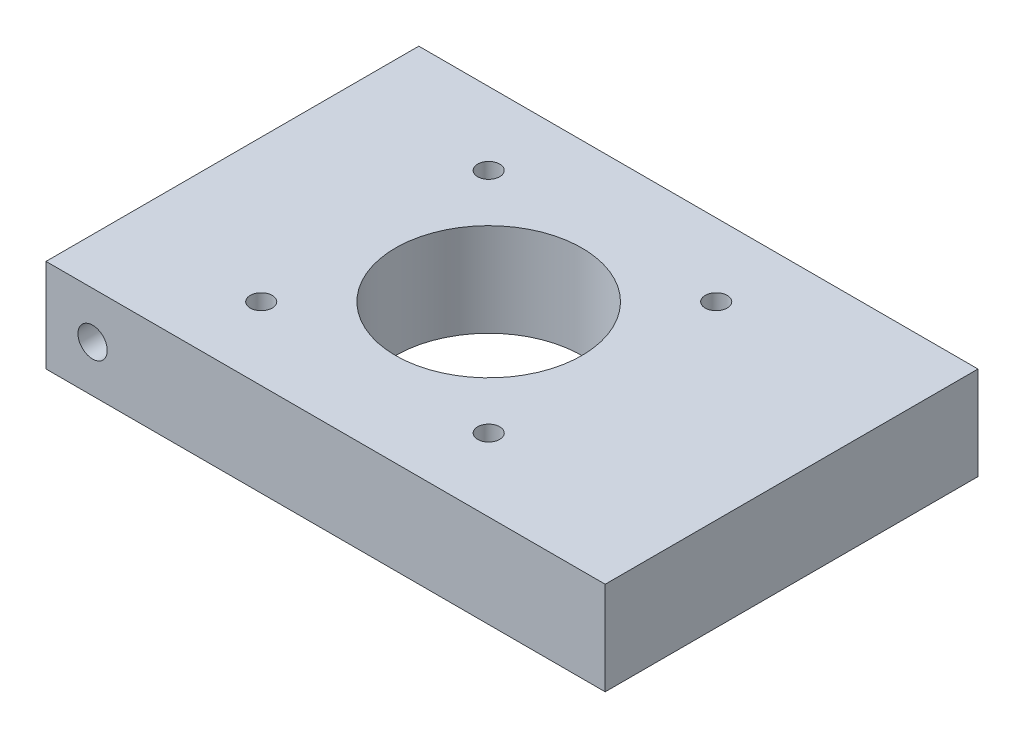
ISO-10303-21;
HEADER;
FILE_DESCRIPTION(('STEP AP214'),'2;1');
FILE_NAME('part.step','',(''),(''),'','','');
FILE_SCHEMA(('AUTOMOTIVE_DESIGN { 1 0 10303 214 1 1 1 1 }'));
ENDSEC;
DATA;
#1=APPLICATION_CONTEXT('core data for automotive mechanical design processes');
#2=APPLICATION_PROTOCOL_DEFINITION('international standard','automotive_design',2000,#1);
#3=PRODUCT_CONTEXT('',#1,'mechanical');
#4=PRODUCT('Part','Part','',(#3));
#5=PRODUCT_RELATED_PRODUCT_CATEGORY('part','',(#4));
#6=PRODUCT_DEFINITION_FORMATION('','',#4);
#7=PRODUCT_DEFINITION_CONTEXT('part definition',#1,'design');
#8=PRODUCT_DEFINITION('design','',#6,#7);
#9=PRODUCT_DEFINITION_SHAPE('','',#8);
#10=(LENGTH_UNIT() NAMED_UNIT(*) SI_UNIT(.MILLI.,.METRE.));
#11=(NAMED_UNIT(*) PLANE_ANGLE_UNIT() SI_UNIT($,.RADIAN.));
#12=(NAMED_UNIT(*) SI_UNIT($,.STERADIAN.) SOLID_ANGLE_UNIT());
#13=UNCERTAINTY_MEASURE_WITH_UNIT(LENGTH_MEASURE(1.E-05),#10,'distance_accuracy_value','');
#14=(GEOMETRIC_REPRESENTATION_CONTEXT(3) GLOBAL_UNCERTAINTY_ASSIGNED_CONTEXT((#13)) GLOBAL_UNIT_ASSIGNED_CONTEXT((#10,
#11,#12)) REPRESENTATION_CONTEXT('',''));
#15=CARTESIAN_POINT('',(0.,0.,0.));
#16=DIRECTION('',(0.,0.,1.));
#17=DIRECTION('',(1.,0.,0.));
#18=AXIS2_PLACEMENT_3D('',#15,#16,#17);
#19=CARTESIAN_POINT('',(-1.53286803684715,6.35,14.8318881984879));
#20=DIRECTION('',(0.,0.,-1.));
#21=DIRECTION('',(-1.,0.,0.));
#22=AXIS2_PLACEMENT_3D('',#19,#20,#21);
#23=CYLINDRICAL_SURFACE('',#22,2.);
#24=CARTESIAN_POINT('',(-1.53286803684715,6.35,-35.9681118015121));
#25=DIRECTION('',(0.,0.,-1.));
#26=DIRECTION('',(-1.,0.,0.));
#27=AXIS2_PLACEMENT_3D('',#24,#25,#26);
#28=CIRCLE('',#27,2.);
#29=CARTESIAN_POINT('',(-3.53286803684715,6.35,-35.9681118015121));
#30=VERTEX_POINT('',#29);
#31=EDGE_CURVE('E204',#30,#30,#28,.T.);
#32=ORIENTED_EDGE('',*,*,#31,.T.);
#33=EDGE_LOOP('',(#32));
#34=FACE_BOUND('',#33,.T.);
#35=CARTESIAN_POINT('',(-1.53286803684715,6.35,-10.5681118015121));
#36=DIRECTION('',(0.,0.,1.));
#37=DIRECTION('',(1.,0.,0.));
#38=AXIS2_PLACEMENT_3D('',#35,#36,#37);
#39=CIRCLE('',#38,2.);
#40=CARTESIAN_POINT('',(0.467131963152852,6.35,-10.5681118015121));
#41=VERTEX_POINT('',#40);
#42=EDGE_CURVE('E11',#41,#41,#39,.F.);
#43=ORIENTED_EDGE('',*,*,#42,.F.);
#44=EDGE_LOOP('',(#43));
#45=FACE_BOUND('',#44,.T.);
#46=ADVANCED_FACE('F33',(#34,#45),#23,.F.);
#47=CARTESIAN_POINT('',(-71.3828680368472,12.7,-35.9681118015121));
#48=DIRECTION('',(1.,0.,0.));
#49=DIRECTION('',(0.,0.,-1.));
#50=AXIS2_PLACEMENT_3D('',#47,#48,#49);
#51=PLANE('',#50);
#52=DIRECTION('',(0.,0.,1.));
#53=VECTOR('',#52,1.);
#54=CARTESIAN_POINT('',(-71.3828680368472,0.,-35.9681118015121));
#55=LINE('',#54,#53);
#56=CARTESIAN_POINT('',(-71.3828680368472,0.,-35.9681118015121));
#57=VERTEX_POINT('',#56);
#58=CARTESIAN_POINT('',(-71.3828680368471,0.,14.8318881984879));
#59=VERTEX_POINT('',#58);
#60=EDGE_CURVE('E100',#57,#59,#55,.T.);
#61=ORIENTED_EDGE('',*,*,#60,.T.);
#62=DIRECTION('',(0.,-1.,0.));
#63=VECTOR('',#62,1.);
#64=CARTESIAN_POINT('',(-71.3828680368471,12.7,14.8318881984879));
#65=LINE('',#64,#63);
#66=CARTESIAN_POINT('',(-71.3828680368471,12.7,14.8318881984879));
#67=VERTEX_POINT('',#66);
#68=EDGE_CURVE('E42',#67,#59,#65,.T.);
#69=ORIENTED_EDGE('',*,*,#68,.F.);
#70=DIRECTION('',(0.,0.,1.));
#71=VECTOR('',#70,1.);
#72=CARTESIAN_POINT('',(-71.3828680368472,12.7,-35.9681118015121));
#73=LINE('',#72,#71);
#74=CARTESIAN_POINT('',(-71.3828680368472,12.7,-35.9681118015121));
#75=VERTEX_POINT('',#74);
#76=EDGE_CURVE('E86',#75,#67,#73,.T.);
#77=ORIENTED_EDGE('',*,*,#76,.F.);
#78=DIRECTION('',(0.,-1.,0.));
#79=VECTOR('',#78,1.);
#80=CARTESIAN_POINT('',(-71.3828680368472,12.7,-35.9681118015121));
#81=LINE('',#80,#79);
#82=EDGE_CURVE('E96',#75,#57,#81,.T.);
#83=ORIENTED_EDGE('',*,*,#82,.T.);
#84=EDGE_LOOP('',(#61,#69,#77,#83));
#85=FACE_BOUND('',#84,.T.);
#86=ADVANCED_FACE('F35',(#85),#51,.F.);
#87=CARTESIAN_POINT('',(-71.3828680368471,12.7,14.8318881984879));
#88=DIRECTION('',(0.,0.,-1.));
#89=DIRECTION('',(-1.,0.,0.));
#90=AXIS2_PLACEMENT_3D('',#87,#88,#89);
#91=PLANE('',#90);
#92=CARTESIAN_POINT('',(-65.0328680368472,6.35,14.8318881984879));
#93=DIRECTION('',(0.,0.,-1.));
#94=DIRECTION('',(-1.,0.,0.));
#95=AXIS2_PLACEMENT_3D('',#92,#93,#94);
#96=CIRCLE('',#95,2.);
#97=CARTESIAN_POINT('',(-67.0328680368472,6.35,14.8318881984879));
#98=VERTEX_POINT('',#97);
#99=EDGE_CURVE('E199',#98,#98,#96,.T.);
#100=ORIENTED_EDGE('',*,*,#99,.T.);
#101=EDGE_LOOP('',(#100));
#102=FACE_BOUND('',#101,.T.);
#103=DIRECTION('',(1.,0.,0.));
#104=VECTOR('',#103,1.);
#105=CARTESIAN_POINT('',(-71.3828680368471,0.,14.8318881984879));
#106=LINE('',#105,#104);
#107=CARTESIAN_POINT('',(4.81713196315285,0.,14.8318881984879));
#108=VERTEX_POINT('',#107);
#109=EDGE_CURVE('E91',#59,#108,#106,.T.);
#110=ORIENTED_EDGE('',*,*,#109,.T.);
#111=DIRECTION('',(0.,-1.,0.));
#112=VECTOR('',#111,1.);
#113=CARTESIAN_POINT('',(4.81713196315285,12.7,14.8318881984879));
#114=LINE('',#113,#112);
#115=CARTESIAN_POINT('',(4.81713196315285,12.7,14.8318881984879));
#116=VERTEX_POINT('',#115);
#117=EDGE_CURVE('E89',#116,#108,#114,.T.);
#118=ORIENTED_EDGE('',*,*,#117,.F.);
#119=DIRECTION('',(1.,0.,0.));
#120=VECTOR('',#119,1.);
#121=CARTESIAN_POINT('',(-71.3828680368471,12.7,14.8318881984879));
#122=LINE('',#121,#120);
#123=EDGE_CURVE('E81',#67,#116,#122,.T.);
#124=ORIENTED_EDGE('',*,*,#123,.F.);
#125=ORIENTED_EDGE('',*,*,#68,.T.);
#126=EDGE_LOOP('',(#110,#118,#124,#125));
#127=FACE_BOUND('',#126,.T.);
#128=ADVANCED_FACE('F90',(#102,#127),#91,.F.);
#129=CARTESIAN_POINT('',(4.81713196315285,12.7,-35.9681118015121));
#130=DIRECTION('',(-1.,0.,0.));
#131=DIRECTION('',(0.,0.,1.));
#132=AXIS2_PLACEMENT_3D('',#129,#130,#131);
#133=PLANE('',#132);
#134=DIRECTION('',(0.,0.,-1.));
#135=VECTOR('',#134,1.);
#136=CARTESIAN_POINT('',(4.81713196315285,0.,-35.9681118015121));
#137=LINE('',#136,#135);
#138=CARTESIAN_POINT('',(4.81713196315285,0.,-35.9681118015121));
#139=VERTEX_POINT('',#138);
#140=EDGE_CURVE('E67',#108,#139,#137,.T.);
#141=ORIENTED_EDGE('',*,*,#140,.T.);
#142=DIRECTION('',(0.,-1.,0.));
#143=VECTOR('',#142,1.);
#144=CARTESIAN_POINT('',(4.81713196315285,12.7,-35.9681118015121));
#145=LINE('',#144,#143);
#146=CARTESIAN_POINT('',(4.81713196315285,12.7,-35.9681118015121));
#147=VERTEX_POINT('',#146);
#148=EDGE_CURVE('E92',#147,#139,#145,.T.);
#149=ORIENTED_EDGE('',*,*,#148,.F.);
#150=DIRECTION('',(0.,0.,-1.));
#151=VECTOR('',#150,1.);
#152=CARTESIAN_POINT('',(4.81713196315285,12.7,-35.9681118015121));
#153=LINE('',#152,#151);
#154=EDGE_CURVE('E84',#116,#147,#153,.T.);
#155=ORIENTED_EDGE('',*,*,#154,.F.);
#156=ORIENTED_EDGE('',*,*,#117,.T.);
#157=EDGE_LOOP('',(#141,#149,#155,#156));
#158=FACE_BOUND('',#157,.T.);
#159=ADVANCED_FACE('F94',(#158),#133,.F.);
#160=CARTESIAN_POINT('',(-71.3828680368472,12.7,-35.9681118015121));
#161=DIRECTION('',(0.,0.,1.));
#162=DIRECTION('',(1.,0.,0.));
#163=AXIS2_PLACEMENT_3D('',#160,#161,#162);
#164=PLANE('',#163);
#165=ORIENTED_EDGE('',*,*,#31,.F.);
#166=EDGE_LOOP('',(#165));
#167=FACE_BOUND('',#166,.T.);
#168=CARTESIAN_POINT('',(-65.0328680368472,6.35,-35.9681118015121));
#169=DIRECTION('',(0.,0.,-1.));
#170=DIRECTION('',(-1.,0.,0.));
#171=AXIS2_PLACEMENT_3D('',#168,#169,#170);
#172=CIRCLE('',#171,2.);
#173=CARTESIAN_POINT('',(-67.0328680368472,6.35,-35.9681118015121));
#174=VERTEX_POINT('',#173);
#175=EDGE_CURVE('E201',#174,#174,#172,.T.);
#176=ORIENTED_EDGE('',*,*,#175,.F.);
#177=EDGE_LOOP('',(#176));
#178=FACE_BOUND('',#177,.T.);
#179=DIRECTION('',(-1.,0.,0.));
#180=VECTOR('',#179,1.);
#181=CARTESIAN_POINT('',(-71.3828680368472,0.,-35.9681118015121));
#182=LINE('',#181,#180);
#183=EDGE_CURVE('E73',#139,#57,#182,.T.);
#184=ORIENTED_EDGE('',*,*,#183,.T.);
#185=ORIENTED_EDGE('',*,*,#82,.F.);
#186=DIRECTION('',(-1.,0.,0.));
#187=VECTOR('',#186,1.);
#188=CARTESIAN_POINT('',(-71.3828680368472,12.7,-35.9681118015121));
#189=LINE('',#188,#187);
#190=EDGE_CURVE('E50',#147,#75,#189,.T.);
#191=ORIENTED_EDGE('',*,*,#190,.F.);
#192=ORIENTED_EDGE('',*,*,#148,.T.);
#193=EDGE_LOOP('',(#184,#185,#191,#192));
#194=FACE_BOUND('',#193,.T.);
#195=ADVANCED_FACE('F123',(#167,#178,#194),#164,.F.);
#196=CARTESIAN_POINT('',(-71.3828680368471,12.7,14.8318881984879));
#197=DIRECTION('',(0.,1.,0.));
#198=DIRECTION('',(0.,0.,1.));
#199=AXIS2_PLACEMENT_3D('',#196,#197,#198);
#200=PLANE('',#199);
#201=CARTESIAN_POINT('',(-51.9578680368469,12.7,4.93188819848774));
#202=DIRECTION('',(0.,1.,0.));
#203=DIRECTION('',(0.,0.,1.));
#204=AXIS2_PLACEMENT_3D('',#201,#202,#203);
#205=CIRCLE('',#204,1.50000000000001);
#206=CARTESIAN_POINT('',(-51.9578680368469,12.7,6.43188819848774));
#207=VERTEX_POINT('',#206);
#208=EDGE_CURVE('E196',#207,#207,#205,.T.);
#209=ORIENTED_EDGE('',*,*,#208,.F.);
#210=EDGE_LOOP('',(#209));
#211=FACE_BOUND('',#210,.T.);
#212=CARTESIAN_POINT('',(-20.9578680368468,12.7,4.93188819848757));
#213=DIRECTION('',(0.,1.,0.));
#214=DIRECTION('',(0.,0.,1.));
#215=AXIS2_PLACEMENT_3D('',#212,#213,#214);
#216=CIRCLE('',#215,1.50000000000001);
#217=CARTESIAN_POINT('',(-20.9578680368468,12.7,6.43188819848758));
#218=VERTEX_POINT('',#217);
#219=EDGE_CURVE('E190',#218,#218,#216,.T.);
#220=ORIENTED_EDGE('',*,*,#219,.F.);
#221=EDGE_LOOP('',(#220));
#222=FACE_BOUND('',#221,.T.);
#223=CARTESIAN_POINT('',(-20.9578680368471,12.7,-26.0681118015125));
#224=DIRECTION('',(0.,1.,0.));
#225=DIRECTION('',(0.,0.,1.));
#226=AXIS2_PLACEMENT_3D('',#223,#224,#225);
#227=CIRCLE('',#226,1.5);
#228=CARTESIAN_POINT('',(-20.9578680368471,12.7,-24.5681118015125));
#229=VERTEX_POINT('',#228);
#230=EDGE_CURVE('E175',#229,#229,#227,.T.);
#231=ORIENTED_EDGE('',*,*,#230,.F.);
#232=EDGE_LOOP('',(#231));
#233=FACE_BOUND('',#232,.T.);
#234=CARTESIAN_POINT('',(-51.9578680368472,12.7,-26.0681118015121));
#235=DIRECTION('',(0.,1.,0.));
#236=DIRECTION('',(0.,0.,1.));
#237=AXIS2_PLACEMENT_3D('',#234,#235,#236);
#238=CIRCLE('',#237,1.5);
#239=CARTESIAN_POINT('',(-51.9578680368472,12.7,-24.5681118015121));
#240=VERTEX_POINT('',#239);
#241=EDGE_CURVE('E168',#240,#240,#238,.T.);
#242=ORIENTED_EDGE('',*,*,#241,.F.);
#243=EDGE_LOOP('',(#242));
#244=FACE_BOUND('',#243,.T.);
#245=CARTESIAN_POINT('',(-36.4578680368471,12.7,-10.5681118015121));
#246=DIRECTION('',(0.,1.,0.));
#247=DIRECTION('',(0.,0.,1.));
#248=AXIS2_PLACEMENT_3D('',#245,#246,#247);
#249=CIRCLE('',#248,12.7);
#250=CARTESIAN_POINT('',(-36.4578680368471,12.7,2.13188819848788));
#251=VERTEX_POINT('',#250);
#252=EDGE_CURVE('E172',#251,#251,#249,.T.);
#253=ORIENTED_EDGE('',*,*,#252,.F.);
#254=EDGE_LOOP('',(#253));
#255=FACE_BOUND('',#254,.T.);
#256=ORIENTED_EDGE('',*,*,#76,.T.);
#257=ORIENTED_EDGE('',*,*,#123,.T.);
#258=ORIENTED_EDGE('',*,*,#154,.T.);
#259=ORIENTED_EDGE('',*,*,#190,.T.);
#260=EDGE_LOOP('',(#256,#257,#258,#259));
#261=FACE_BOUND('',#260,.T.);
#262=ADVANCED_FACE('F82',(#211,#222,#233,#244,#255,#261),#200,.T.);
#263=CARTESIAN_POINT('',(-71.3828680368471,0.,14.8318881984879));
#264=DIRECTION('',(0.,1.,0.));
#265=DIRECTION('',(0.,0.,1.));
#266=AXIS2_PLACEMENT_3D('',#263,#264,#265);
#267=PLANE('',#266);
#268=CARTESIAN_POINT('',(-51.9578680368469,0.,4.93188819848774));
#269=DIRECTION('',(0.,1.,0.));
#270=DIRECTION('',(0.,0.,1.));
#271=AXIS2_PLACEMENT_3D('',#268,#269,#270);
#272=CIRCLE('',#271,1.50000000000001);
#273=CARTESIAN_POINT('',(-51.9578680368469,0.,6.43188819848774));
#274=VERTEX_POINT('',#273);
#275=EDGE_CURVE('E193',#274,#274,#272,.T.);
#276=ORIENTED_EDGE('',*,*,#275,.T.);
#277=EDGE_LOOP('',(#276));
#278=FACE_BOUND('',#277,.T.);
#279=CARTESIAN_POINT('',(-20.9578680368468,0.,4.93188819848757));
#280=DIRECTION('',(0.,1.,0.));
#281=DIRECTION('',(0.,0.,1.));
#282=AXIS2_PLACEMENT_3D('',#279,#280,#281);
#283=CIRCLE('',#282,1.50000000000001);
#284=CARTESIAN_POINT('',(-20.9578680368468,0.,6.43188819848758));
#285=VERTEX_POINT('',#284);
#286=EDGE_CURVE('E188',#285,#285,#283,.T.);
#287=ORIENTED_EDGE('',*,*,#286,.T.);
#288=EDGE_LOOP('',(#287));
#289=FACE_BOUND('',#288,.T.);
#290=CARTESIAN_POINT('',(-20.9578680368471,0.,-26.0681118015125));
#291=DIRECTION('',(0.,1.,0.));
#292=DIRECTION('',(0.,0.,1.));
#293=AXIS2_PLACEMENT_3D('',#290,#291,#292);
#294=CIRCLE('',#293,1.5);
#295=CARTESIAN_POINT('',(-20.9578680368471,0.,-24.5681118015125));
#296=VERTEX_POINT('',#295);
#297=EDGE_CURVE('E170',#296,#296,#294,.T.);
#298=ORIENTED_EDGE('',*,*,#297,.T.);
#299=EDGE_LOOP('',(#298));
#300=FACE_BOUND('',#299,.T.);
#301=CARTESIAN_POINT('',(-51.9578680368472,0.,-26.0681118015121));
#302=DIRECTION('',(0.,1.,0.));
#303=DIRECTION('',(0.,0.,1.));
#304=AXIS2_PLACEMENT_3D('',#301,#302,#303);
#305=CIRCLE('',#304,1.5);
#306=CARTESIAN_POINT('',(-51.9578680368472,0.,-24.5681118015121));
#307=VERTEX_POINT('',#306);
#308=EDGE_CURVE('E165',#307,#307,#305,.T.);
#309=ORIENTED_EDGE('',*,*,#308,.T.);
#310=EDGE_LOOP('',(#309));
#311=FACE_BOUND('',#310,.T.);
#312=CARTESIAN_POINT('',(-36.4578680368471,0.,-10.5681118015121));
#313=DIRECTION('',(0.,1.,0.));
#314=DIRECTION('',(0.,0.,1.));
#315=AXIS2_PLACEMENT_3D('',#312,#313,#314);
#316=CIRCLE('',#315,12.7);
#317=CARTESIAN_POINT('',(-36.4578680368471,0.,2.13188819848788));
#318=VERTEX_POINT('',#317);
#319=EDGE_CURVE('E103',#318,#318,#316,.T.);
#320=ORIENTED_EDGE('',*,*,#319,.T.);
#321=EDGE_LOOP('',(#320));
#322=FACE_BOUND('',#321,.T.);
#323=ORIENTED_EDGE('',*,*,#60,.F.);
#324=ORIENTED_EDGE('',*,*,#183,.F.);
#325=ORIENTED_EDGE('',*,*,#140,.F.);
#326=ORIENTED_EDGE('',*,*,#109,.F.);
#327=EDGE_LOOP('',(#323,#324,#325,#326));
#328=FACE_BOUND('',#327,.T.);
#329=ADVANCED_FACE('F111',(#278,#289,#300,#311,#322,#328),#267,.F.);
#330=CARTESIAN_POINT('',(-36.4578680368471,0.,-10.5681118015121));
#331=DIRECTION('',(0.,1.,0.));
#332=DIRECTION('',(0.,0.,1.));
#333=AXIS2_PLACEMENT_3D('',#330,#331,#332);
#334=CYLINDRICAL_SURFACE('',#333,12.7);
#335=ORIENTED_EDGE('',*,*,#319,.F.);
#336=EDGE_LOOP('',(#335));
#337=FACE_BOUND('',#336,.T.);
#338=ORIENTED_EDGE('',*,*,#252,.T.);
#339=EDGE_LOOP('',(#338));
#340=FACE_BOUND('',#339,.T.);
#341=ADVANCED_FACE('F113',(#337,#340),#334,.F.);
#342=CARTESIAN_POINT('',(-51.9578680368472,0.,-26.0681118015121));
#343=DIRECTION('',(0.,1.,0.));
#344=DIRECTION('',(0.,0.,1.));
#345=AXIS2_PLACEMENT_3D('',#342,#343,#344);
#346=CYLINDRICAL_SURFACE('',#345,1.5);
#347=ORIENTED_EDGE('',*,*,#308,.F.);
#348=EDGE_LOOP('',(#347));
#349=FACE_BOUND('',#348,.T.);
#350=ORIENTED_EDGE('',*,*,#241,.T.);
#351=EDGE_LOOP('',(#350));
#352=FACE_BOUND('',#351,.T.);
#353=ADVANCED_FACE('F120',(#349,#352),#346,.F.);
#354=CARTESIAN_POINT('',(-20.9578680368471,0.,-26.0681118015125));
#355=DIRECTION('',(0.,1.,0.));
#356=DIRECTION('',(0.,0.,1.));
#357=AXIS2_PLACEMENT_3D('',#354,#355,#356);
#358=CYLINDRICAL_SURFACE('',#357,1.5);
#359=ORIENTED_EDGE('',*,*,#297,.F.);
#360=EDGE_LOOP('',(#359));
#361=FACE_BOUND('',#360,.T.);
#362=ORIENTED_EDGE('',*,*,#230,.T.);
#363=EDGE_LOOP('',(#362));
#364=FACE_BOUND('',#363,.T.);
#365=ADVANCED_FACE('F153',(#361,#364),#358,.F.);
#366=CARTESIAN_POINT('',(-20.9578680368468,0.,4.93188819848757));
#367=DIRECTION('',(0.,1.,0.));
#368=DIRECTION('',(0.,0.,1.));
#369=AXIS2_PLACEMENT_3D('',#366,#367,#368);
#370=CYLINDRICAL_SURFACE('',#369,1.50000000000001);
#371=ORIENTED_EDGE('',*,*,#286,.F.);
#372=EDGE_LOOP('',(#371));
#373=FACE_BOUND('',#372,.T.);
#374=ORIENTED_EDGE('',*,*,#219,.T.);
#375=EDGE_LOOP('',(#374));
#376=FACE_BOUND('',#375,.T.);
#377=ADVANCED_FACE('F149',(#373,#376),#370,.F.);
#378=CARTESIAN_POINT('',(-51.9578680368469,0.,4.93188819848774));
#379=DIRECTION('',(0.,1.,0.));
#380=DIRECTION('',(0.,0.,1.));
#381=AXIS2_PLACEMENT_3D('',#378,#379,#380);
#382=CYLINDRICAL_SURFACE('',#381,1.50000000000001);
#383=ORIENTED_EDGE('',*,*,#275,.F.);
#384=EDGE_LOOP('',(#383));
#385=FACE_BOUND('',#384,.T.);
#386=ORIENTED_EDGE('',*,*,#208,.T.);
#387=EDGE_LOOP('',(#386));
#388=FACE_BOUND('',#387,.T.);
#389=ADVANCED_FACE('F145',(#385,#388),#382,.F.);
#390=CARTESIAN_POINT('',(-65.0328680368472,6.35,14.8318881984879));
#391=DIRECTION('',(0.,0.,-1.));
#392=DIRECTION('',(-1.,0.,0.));
#393=AXIS2_PLACEMENT_3D('',#390,#391,#392);
#394=CYLINDRICAL_SURFACE('',#393,2.);
#395=ORIENTED_EDGE('',*,*,#99,.F.);
#396=EDGE_LOOP('',(#395));
#397=FACE_BOUND('',#396,.T.);
#398=ORIENTED_EDGE('',*,*,#175,.T.);
#399=EDGE_LOOP('',(#398));
#400=FACE_BOUND('',#399,.T.);
#401=ADVANCED_FACE('F142',(#397,#400),#394,.F.);
#402=CARTESIAN_POINT('',(-1.53286803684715,6.35,-10.5681118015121));
#403=DIRECTION('',(0.,0.,1.));
#404=DIRECTION('',(1.,0.,0.));
#405=AXIS2_PLACEMENT_3D('',#402,#403,#404);
#406=PLANE('',#405);
#407=ORIENTED_EDGE('',*,*,#42,.T.);
#408=EDGE_LOOP('',(#407));
#409=FACE_BOUND('',#408,.T.);
#410=ADVANCED_FACE('F141',(#409),#406,.F.);
#411=CLOSED_SHELL('',(#46,#86,#128,#159,#195,#262,#329,#341,#353,#365,#377,#389,#401,#410));
#412=MANIFOLD_SOLID_BREP('B2',#411);
#413=ADVANCED_BREP_SHAPE_REPRESENTATION('',(#18,#412),#14);
#414=SHAPE_DEFINITION_REPRESENTATION(#9,#413);
ENDSEC;
END-ISO-10303-21;
